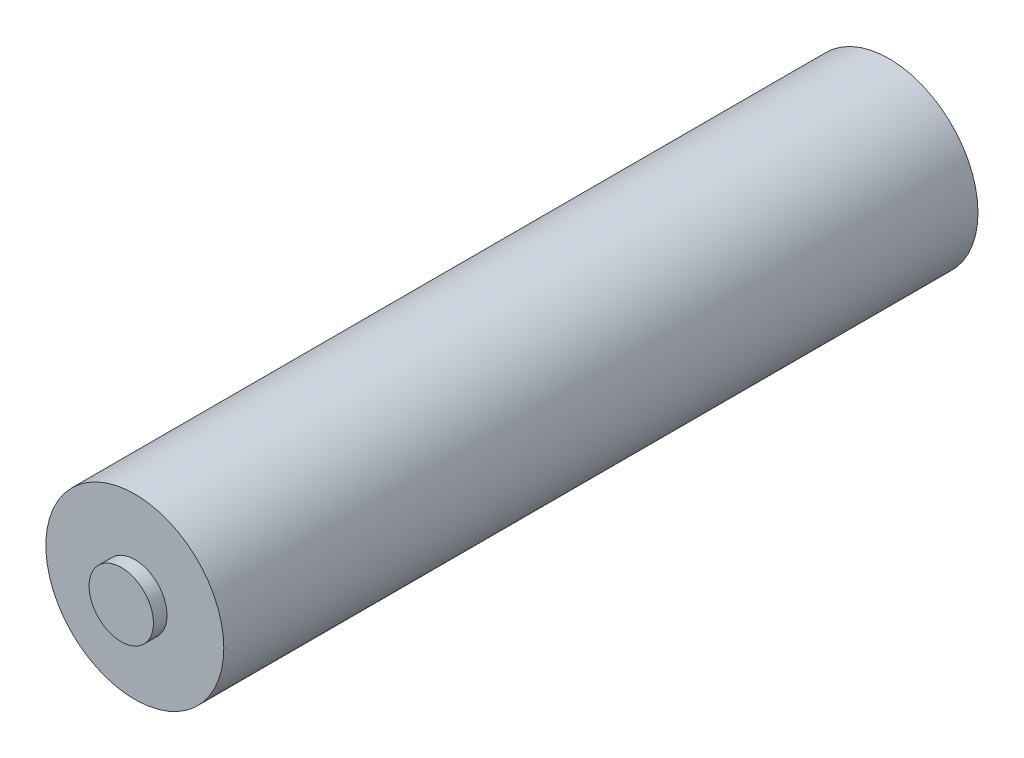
ISO-10303-21;
HEADER;
FILE_DESCRIPTION(('STEP AP214'),'2;1');
FILE_NAME('part.step','',(''),(''),'','','');
FILE_SCHEMA(('AUTOMOTIVE_DESIGN { 1 0 10303 214 1 1 1 1 }'));
ENDSEC;
DATA;
#1=APPLICATION_CONTEXT('core data for automotive mechanical design processes');
#2=APPLICATION_PROTOCOL_DEFINITION('international standard','automotive_design',2000,#1);
#3=PRODUCT_CONTEXT('',#1,'mechanical');
#4=PRODUCT('Part','Part','',(#3));
#5=PRODUCT_RELATED_PRODUCT_CATEGORY('part','',(#4));
#6=PRODUCT_DEFINITION_FORMATION('','',#4);
#7=PRODUCT_DEFINITION_CONTEXT('part definition',#1,'design');
#8=PRODUCT_DEFINITION('design','',#6,#7);
#9=PRODUCT_DEFINITION_SHAPE('','',#8);
#10=(LENGTH_UNIT() NAMED_UNIT(*) SI_UNIT(.MILLI.,.METRE.));
#11=(NAMED_UNIT(*) PLANE_ANGLE_UNIT() SI_UNIT($,.RADIAN.));
#12=(NAMED_UNIT(*) SI_UNIT($,.STERADIAN.) SOLID_ANGLE_UNIT());
#13=UNCERTAINTY_MEASURE_WITH_UNIT(LENGTH_MEASURE(1.E-05),#10,'distance_accuracy_value','');
#14=(GEOMETRIC_REPRESENTATION_CONTEXT(3) GLOBAL_UNCERTAINTY_ASSIGNED_CONTEXT((#13)) GLOBAL_UNIT_ASSIGNED_CONTEXT((#10,
#11,#12)) REPRESENTATION_CONTEXT('',''));
#15=CARTESIAN_POINT('',(0.,0.,0.));
#16=DIRECTION('',(0.,0.,1.));
#17=DIRECTION('',(1.,0.,0.));
#18=AXIS2_PLACEMENT_3D('',#15,#16,#17);
#19=CARTESIAN_POINT('',(0.,0.,22.25));
#20=DIRECTION('',(0.,0.,1.));
#21=DIRECTION('',(1.,0.,0.));
#22=AXIS2_PLACEMENT_3D('',#19,#20,#21);
#23=PLANE('',#22);
#24=CARTESIAN_POINT('',(0.,0.,22.25));
#25=DIRECTION('',(0.,0.,1.));
#26=DIRECTION('',(1.,0.,0.));
#27=AXIS2_PLACEMENT_3D('',#24,#25,#26);
#28=CIRCLE('',#27,5.25);
#29=CARTESIAN_POINT('',(5.25,0.,22.25));
#30=VERTEX_POINT('',#29);
#31=EDGE_CURVE('E10',#30,#30,#28,.T.);
#32=ORIENTED_EDGE('',*,*,#31,.T.);
#33=EDGE_LOOP('',(#32));
#34=FACE_BOUND('',#33,.T.);
#35=CARTESIAN_POINT('',(0.,0.,22.25));
#36=DIRECTION('',(0.,0.,1.));
#37=DIRECTION('',(1.,0.,0.));
#38=AXIS2_PLACEMENT_3D('',#35,#36,#37);
#39=CIRCLE('',#38,1.89992);
#40=CARTESIAN_POINT('',(-1.89992,0.,22.25));
#41=VERTEX_POINT('',#40);
#42=EDGE_CURVE('E39',#41,#41,#39,.T.);
#43=ORIENTED_EDGE('',*,*,#42,.F.);
#44=EDGE_LOOP('',(#43));
#45=FACE_BOUND('',#44,.T.);
#46=ADVANCED_FACE('F24',(#34,#45),#23,.T.);
#47=CARTESIAN_POINT('',(0.,0.,22.25));
#48=DIRECTION('',(0.,0.,-1.));
#49=DIRECTION('',(-1.,0.,0.));
#50=AXIS2_PLACEMENT_3D('',#47,#48,#49);
#51=CYLINDRICAL_SURFACE('',#50,5.25);
#52=ORIENTED_EDGE('',*,*,#31,.F.);
#53=EDGE_LOOP('',(#52));
#54=FACE_BOUND('',#53,.T.);
#55=CARTESIAN_POINT('',(0.,0.,-22.25));
#56=DIRECTION('',(0.,0.,1.));
#57=DIRECTION('',(1.,0.,0.));
#58=AXIS2_PLACEMENT_3D('',#55,#56,#57);
#59=CIRCLE('',#58,5.25);
#60=CARTESIAN_POINT('',(5.25,0.,-22.25));
#61=VERTEX_POINT('',#60);
#62=EDGE_CURVE('E31',#61,#61,#59,.T.);
#63=ORIENTED_EDGE('',*,*,#62,.T.);
#64=EDGE_LOOP('',(#63));
#65=FACE_BOUND('',#64,.T.);
#66=ADVANCED_FACE('F26',(#54,#65),#51,.T.);
#67=CARTESIAN_POINT('',(0.,0.,-22.25));
#68=DIRECTION('',(0.,0.,1.));
#69=DIRECTION('',(1.,0.,0.));
#70=AXIS2_PLACEMENT_3D('',#67,#68,#69);
#71=PLANE('',#70);
#72=ORIENTED_EDGE('',*,*,#62,.F.);
#73=EDGE_LOOP('',(#72));
#74=FACE_BOUND('',#73,.T.);
#75=ADVANCED_FACE('F53',(#74),#71,.F.);
#76=CARTESIAN_POINT('',(0.,0.,23.049846));
#77=DIRECTION('',(0.,0.,-1.));
#78=DIRECTION('',(-1.,0.,0.));
#79=AXIS2_PLACEMENT_3D('',#76,#77,#78);
#80=CYLINDRICAL_SURFACE('',#79,1.89992);
#81=CARTESIAN_POINT('',(0.,0.,23.049846));
#82=DIRECTION('',(0.,0.,1.));
#83=DIRECTION('',(1.,0.,0.));
#84=AXIS2_PLACEMENT_3D('',#81,#82,#83);
#85=CIRCLE('',#84,1.89992);
#86=CARTESIAN_POINT('',(-1.89992,0.,23.049846));
#87=VERTEX_POINT('',#86);
#88=EDGE_CURVE('E35',#87,#87,#85,.T.);
#89=CARTESIAN_POINT('',(-1.89992,0.,23.049846));
#90=CARTESIAN_POINT('',(-1.89992,0.,23.0415142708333));
#91=CARTESIAN_POINT('',(-1.89992,0.,23.0331825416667));
#92=CARTESIAN_POINT('',(-1.89992,0.,23.0165190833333));
#93=CARTESIAN_POINT('',(-1.89992,0.,23.0081873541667));
#94=CARTESIAN_POINT('',(-1.89992,0.,22.9915238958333));
#95=CARTESIAN_POINT('',(-1.89992,0.,22.9831921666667));
#96=CARTESIAN_POINT('',(-1.89992,0.,22.9665287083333));
#97=CARTESIAN_POINT('',(-1.89992,0.,22.9581969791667));
#98=CARTESIAN_POINT('',(-1.89992,0.,22.9415335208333));
#99=CARTESIAN_POINT('',(-1.89992,0.,22.9332017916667));
#100=CARTESIAN_POINT('',(-1.89992,0.,22.9165383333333));
#101=CARTESIAN_POINT('',(-1.89992,0.,22.9082066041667));
#102=CARTESIAN_POINT('',(-1.89992,0.,22.8915431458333));
#103=CARTESIAN_POINT('',(-1.89992,0.,22.8832114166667));
#104=CARTESIAN_POINT('',(-1.89992,0.,22.8665479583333));
#105=CARTESIAN_POINT('',(-1.89992,0.,22.8582162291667));
#106=CARTESIAN_POINT('',(-1.89992,0.,22.8415527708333));
#107=CARTESIAN_POINT('',(-1.89992,0.,22.8332210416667));
#108=CARTESIAN_POINT('',(-1.89992,0.,22.8165575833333));
#109=CARTESIAN_POINT('',(-1.89992,0.,22.8082258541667));
#110=CARTESIAN_POINT('',(-1.89992,0.,22.7915623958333));
#111=CARTESIAN_POINT('',(-1.89992,0.,22.7832306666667));
#112=CARTESIAN_POINT('',(-1.89992,0.,22.7665672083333));
#113=CARTESIAN_POINT('',(-1.89992,0.,22.7582354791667));
#114=CARTESIAN_POINT('',(-1.89992,0.,22.7415720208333));
#115=CARTESIAN_POINT('',(-1.89992,0.,22.7332402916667));
#116=CARTESIAN_POINT('',(-1.89992,0.,22.7165768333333));
#117=CARTESIAN_POINT('',(-1.89992,0.,22.7082451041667));
#118=CARTESIAN_POINT('',(-1.89992,0.,22.6915816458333));
#119=CARTESIAN_POINT('',(-1.89992,0.,22.6832499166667));
#120=CARTESIAN_POINT('',(-1.89992,0.,22.6665864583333));
#121=CARTESIAN_POINT('',(-1.89992,0.,22.6582547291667));
#122=CARTESIAN_POINT('',(-1.89992,0.,22.6415912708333));
#123=CARTESIAN_POINT('',(-1.89992,0.,22.6332595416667));
#124=CARTESIAN_POINT('',(-1.89992,0.,22.6165960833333));
#125=CARTESIAN_POINT('',(-1.89992,0.,22.6082643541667));
#126=CARTESIAN_POINT('',(-1.89992,0.,22.5916008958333));
#127=CARTESIAN_POINT('',(-1.89992,0.,22.5832691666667));
#128=CARTESIAN_POINT('',(-1.89992,0.,22.5666057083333));
#129=CARTESIAN_POINT('',(-1.89992,0.,22.5582739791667));
#130=CARTESIAN_POINT('',(-1.89992,0.,22.5416105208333));
#131=CARTESIAN_POINT('',(-1.89992,0.,22.5332787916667));
#132=CARTESIAN_POINT('',(-1.89992,0.,22.5166153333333));
#133=CARTESIAN_POINT('',(-1.89992,0.,22.5082836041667));
#134=CARTESIAN_POINT('',(-1.89992,0.,22.4916201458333));
#135=CARTESIAN_POINT('',(-1.89992,0.,22.4832884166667));
#136=CARTESIAN_POINT('',(-1.89992,0.,22.4666249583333));
#137=CARTESIAN_POINT('',(-1.89992,0.,22.4582932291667));
#138=CARTESIAN_POINT('',(-1.89992,0.,22.4416297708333));
#139=CARTESIAN_POINT('',(-1.89992,0.,22.4332980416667));
#140=CARTESIAN_POINT('',(-1.89992,0.,22.4166345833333));
#141=CARTESIAN_POINT('',(-1.89992,0.,22.4083028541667));
#142=CARTESIAN_POINT('',(-1.89992,0.,22.3916393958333));
#143=CARTESIAN_POINT('',(-1.89992,0.,22.3833076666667));
#144=CARTESIAN_POINT('',(-1.89992,0.,22.3666442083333));
#145=CARTESIAN_POINT('',(-1.89992,0.,22.3583124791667));
#146=CARTESIAN_POINT('',(-1.89992,0.,22.3416490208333));
#147=CARTESIAN_POINT('',(-1.89992,0.,22.3333172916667));
#148=CARTESIAN_POINT('',(-1.89992,0.,22.3166538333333));
#149=CARTESIAN_POINT('',(-1.89992,0.,22.3083221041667));
#150=CARTESIAN_POINT('',(-1.89992,0.,22.2916586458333));
#151=CARTESIAN_POINT('',(-1.89992,0.,22.2833269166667));
#152=CARTESIAN_POINT('',(-1.89992,0.,22.2666634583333));
#153=CARTESIAN_POINT('',(-1.89992,0.,22.2583317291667));
#154=CARTESIAN_POINT('',(-1.89992,0.,22.25));
#155=B_SPLINE_CURVE_WITH_KNOTS('',3,(#89,#90,#91,#92,#93,#94,#95,#96,#97,#98,#99,#100,#101,#102,
#103,#104,#105,#106,#107,#108,#109,#110,#111,#112,#113,#114,#115,#116,#117,#118,#119,#120,#121,
#122,#123,#124,#125,#126,#127,#128,#129,#130,#131,#132,#133,#134,#135,#136,#137,#138,#139,#140,
#141,#142,#143,#144,#145,#146,#147,#148,#149,#150,#151,#152,#153,#154),.UNSPECIFIED.,.F.,.F.,(4,
2,2,2,2,2,2,2,2,2,2,2,2,2,2,2,2,2,2,2,2,2,2,2,2,2,2,2,2,2,2,2,4),(0.,0.024995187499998,
0.0499903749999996,0.0749855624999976,0.0999807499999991,0.124975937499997,0.149971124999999,
0.174966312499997,0.199961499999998,0.2249566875,0.249951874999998,0.274947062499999,
0.299942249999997,0.324937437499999,0.349932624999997,0.374927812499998,0.399923,
0.424918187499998,0.449913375,0.474908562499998,0.499903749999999,0.524898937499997,
0.549894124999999,0.574889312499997,0.599884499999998,0.6248796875,0.649874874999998,
0.674870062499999,0.699865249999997,0.724860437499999,0.749855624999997,0.774850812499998,
0.799846),.UNSPECIFIED.);
#156=EDGE_CURVE('BSEAM45',#87,#41,#155,.T.);
#157=ORIENTED_EDGE('',*,*,#88,.F.);
#158=ORIENTED_EDGE('',*,*,#42,.T.);
#159=ORIENTED_EDGE('',*,*,#156,.T.);
#160=ORIENTED_EDGE('',*,*,#156,.F.);
#161=EDGE_LOOP('',(#157,#159,#158,#160));
#162=FACE_BOUND('',#161,.T.);
#163=ADVANCED_FACE('F45',(#162),#80,.T.);
#164=CARTESIAN_POINT('',(0.,0.,23.049846));
#165=DIRECTION('',(0.,0.,1.));
#166=DIRECTION('',(1.,0.,0.));
#167=AXIS2_PLACEMENT_3D('',#164,#165,#166);
#168=PLANE('',#167);
#169=ORIENTED_EDGE('',*,*,#88,.T.);
#170=EDGE_LOOP('',(#169));
#171=FACE_BOUND('',#170,.T.);
#172=ADVANCED_FACE('F59',(#171),#168,.T.);
#173=CLOSED_SHELL('',(#46,#66,#75,#163,#172));
#174=MANIFOLD_SOLID_BREP('B2',#173);
#175=ADVANCED_BREP_SHAPE_REPRESENTATION('',(#18,#174),#14);
#176=SHAPE_DEFINITION_REPRESENTATION(#9,#175);
ENDSEC;
END-ISO-10303-21;
